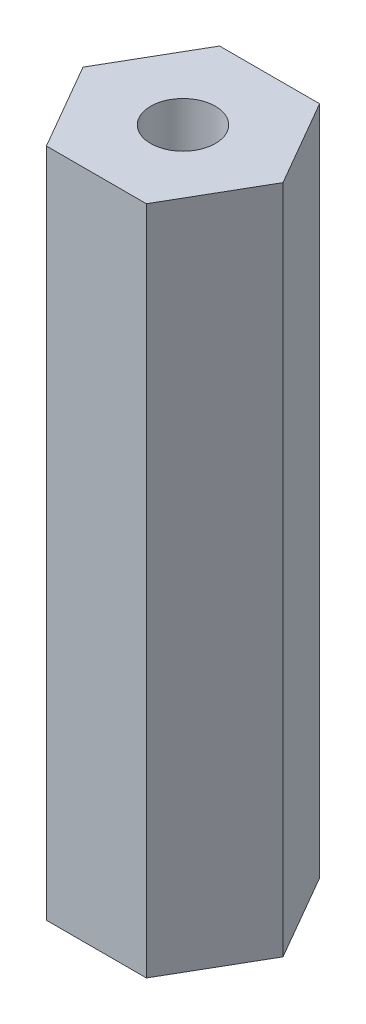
ISO-10303-21;
HEADER;
FILE_DESCRIPTION(('STEP AP214'),'2;1');
FILE_NAME('part.step','',(''),(''),'','','');
FILE_SCHEMA(('AUTOMOTIVE_DESIGN { 1 0 10303 214 1 1 1 1 }'));
ENDSEC;
DATA;
#1=APPLICATION_CONTEXT('core data for automotive mechanical design processes');
#2=APPLICATION_PROTOCOL_DEFINITION('international standard','automotive_design',2000,#1);
#3=PRODUCT_CONTEXT('',#1,'mechanical');
#4=PRODUCT('Part','Part','',(#3));
#5=PRODUCT_RELATED_PRODUCT_CATEGORY('part','',(#4));
#6=PRODUCT_DEFINITION_FORMATION('','',#4);
#7=PRODUCT_DEFINITION_CONTEXT('part definition',#1,'design');
#8=PRODUCT_DEFINITION('design','',#6,#7);
#9=PRODUCT_DEFINITION_SHAPE('','',#8);
#10=(LENGTH_UNIT() NAMED_UNIT(*) SI_UNIT(.MILLI.,.METRE.));
#11=(NAMED_UNIT(*) PLANE_ANGLE_UNIT() SI_UNIT($,.RADIAN.));
#12=(NAMED_UNIT(*) SI_UNIT($,.STERADIAN.) SOLID_ANGLE_UNIT());
#13=UNCERTAINTY_MEASURE_WITH_UNIT(LENGTH_MEASURE(1.E-05),#10,'distance_accuracy_value','');
#14=(GEOMETRIC_REPRESENTATION_CONTEXT(3) GLOBAL_UNCERTAINTY_ASSIGNED_CONTEXT((#13)) GLOBAL_UNIT_ASSIGNED_CONTEXT((#10,
#11,#12)) REPRESENTATION_CONTEXT('',''));
#15=CARTESIAN_POINT('',(0.,0.,0.));
#16=DIRECTION('',(0.,0.,1.));
#17=DIRECTION('',(1.,0.,0.));
#18=AXIS2_PLACEMENT_3D('',#15,#16,#17);
#19=CARTESIAN_POINT('',(2.19970452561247,29.499999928,3.81));
#20=DIRECTION('',(-0.866025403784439,0.,-0.5));
#21=DIRECTION('',(-0.5,0.,0.866025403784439));
#22=AXIS2_PLACEMENT_3D('',#19,#20,#21);
#23=PLANE('',#22);
#24=DIRECTION('',(0.5,0.,-0.866025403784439));
#25=VECTOR('',#24,1.);
#26=CARTESIAN_POINT('',(2.19970452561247,0.,3.81));
#27=LINE('',#26,#25);
#28=CARTESIAN_POINT('',(2.19970452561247,0.,3.81));
#29=VERTEX_POINT('',#28);
#30=CARTESIAN_POINT('',(4.39940905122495,0.,0.));
#31=VERTEX_POINT('',#30);
#32=EDGE_CURVE('E128',#29,#31,#27,.T.);
#33=ORIENTED_EDGE('',*,*,#32,.T.);
#34=DIRECTION('',(0.,-1.,0.));
#35=VECTOR('',#34,1.);
#36=CARTESIAN_POINT('',(4.39940905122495,29.499999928,0.));
#37=LINE('',#36,#35);
#38=CARTESIAN_POINT('',(4.39940905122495,29.499999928,0.));
#39=VERTEX_POINT('',#38);
#40=EDGE_CURVE('E11',#39,#31,#37,.T.);
#41=ORIENTED_EDGE('',*,*,#40,.F.);
#42=DIRECTION('',(0.5,0.,-0.866025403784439));
#43=VECTOR('',#42,1.);
#44=CARTESIAN_POINT('',(2.19970452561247,29.499999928,3.81));
#45=LINE('',#44,#43);
#46=CARTESIAN_POINT('',(2.19970452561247,29.499999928,3.81));
#47=VERTEX_POINT('',#46);
#48=EDGE_CURVE('E145',#47,#39,#45,.T.);
#49=ORIENTED_EDGE('',*,*,#48,.F.);
#50=DIRECTION('',(0.,-1.,0.));
#51=VECTOR('',#50,1.);
#52=CARTESIAN_POINT('',(2.19970452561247,29.499999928,3.81));
#53=LINE('',#52,#51);
#54=EDGE_CURVE('E124',#47,#29,#53,.T.);
#55=ORIENTED_EDGE('',*,*,#54,.T.);
#56=EDGE_LOOP('',(#33,#41,#49,#55));
#57=FACE_BOUND('',#56,.T.);
#58=ADVANCED_FACE('F39',(#57),#23,.F.);
#59=CARTESIAN_POINT('',(4.39940905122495,29.499999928,0.));
#60=DIRECTION('',(-0.866025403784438,0.,0.5));
#61=DIRECTION('',(0.5,0.,0.866025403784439));
#62=AXIS2_PLACEMENT_3D('',#59,#60,#61);
#63=PLANE('',#62);
#64=DIRECTION('',(-0.5,0.,-0.866025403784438));
#65=VECTOR('',#64,1.);
#66=CARTESIAN_POINT('',(4.39940905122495,0.,0.));
#67=LINE('',#66,#65);
#68=CARTESIAN_POINT('',(2.19970452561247,0.,-3.81));
#69=VERTEX_POINT('',#68);
#70=EDGE_CURVE('E132',#31,#69,#67,.T.);
#71=ORIENTED_EDGE('',*,*,#70,.T.);
#72=DIRECTION('',(0.,-1.,0.));
#73=VECTOR('',#72,1.);
#74=CARTESIAN_POINT('',(2.19970452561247,29.499999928,-3.81));
#75=LINE('',#74,#73);
#76=CARTESIAN_POINT('',(2.19970452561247,29.499999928,-3.81));
#77=VERTEX_POINT('',#76);
#78=EDGE_CURVE('E48',#77,#69,#75,.T.);
#79=ORIENTED_EDGE('',*,*,#78,.F.);
#80=DIRECTION('',(-0.5,0.,-0.866025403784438));
#81=VECTOR('',#80,1.);
#82=CARTESIAN_POINT('',(4.39940905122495,29.499999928,0.));
#83=LINE('',#82,#81);
#84=EDGE_CURVE('E93',#39,#77,#83,.T.);
#85=ORIENTED_EDGE('',*,*,#84,.F.);
#86=ORIENTED_EDGE('',*,*,#40,.T.);
#87=EDGE_LOOP('',(#71,#79,#85,#86));
#88=FACE_BOUND('',#87,.T.);
#89=ADVANCED_FACE('F174',(#88),#63,.F.);
#90=CARTESIAN_POINT('',(2.19970452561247,29.499999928,-3.81));
#91=DIRECTION('',(0.,0.,1.));
#92=DIRECTION('',(1.,0.,0.));
#93=AXIS2_PLACEMENT_3D('',#90,#91,#92);
#94=PLANE('',#93);
#95=DIRECTION('',(-1.,0.,0.));
#96=VECTOR('',#95,1.);
#97=CARTESIAN_POINT('',(2.19970452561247,0.,-3.81));
#98=LINE('',#97,#96);
#99=CARTESIAN_POINT('',(-2.19970452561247,0.,-3.81));
#100=VERTEX_POINT('',#99);
#101=EDGE_CURVE('E136',#69,#100,#98,.T.);
#102=ORIENTED_EDGE('',*,*,#101,.T.);
#103=DIRECTION('',(0.,-1.,0.));
#104=VECTOR('',#103,1.);
#105=CARTESIAN_POINT('',(-2.19970452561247,29.499999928,-3.81));
#106=LINE('',#105,#104);
#107=CARTESIAN_POINT('',(-2.19970452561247,29.499999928,-3.81));
#108=VERTEX_POINT('',#107);
#109=EDGE_CURVE('E117',#108,#100,#106,.T.);
#110=ORIENTED_EDGE('',*,*,#109,.F.);
#111=DIRECTION('',(-1.,0.,0.));
#112=VECTOR('',#111,1.);
#113=CARTESIAN_POINT('',(2.19970452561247,29.499999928,-3.81));
#114=LINE('',#113,#112);
#115=EDGE_CURVE('E106',#77,#108,#114,.T.);
#116=ORIENTED_EDGE('',*,*,#115,.F.);
#117=ORIENTED_EDGE('',*,*,#78,.T.);
#118=EDGE_LOOP('',(#102,#110,#116,#117));
#119=FACE_BOUND('',#118,.T.);
#120=ADVANCED_FACE('F155',(#119),#94,.F.);
#121=CARTESIAN_POINT('',(-2.19970452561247,29.499999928,-3.81));
#122=DIRECTION('',(0.866025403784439,0.,0.5));
#123=DIRECTION('',(0.5,0.,-0.866025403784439));
#124=AXIS2_PLACEMENT_3D('',#121,#122,#123);
#125=PLANE('',#124);
#126=DIRECTION('',(-0.5,0.,0.866025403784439));
#127=VECTOR('',#126,1.);
#128=CARTESIAN_POINT('',(-2.19970452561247,0.,-3.81));
#129=LINE('',#128,#127);
#130=CARTESIAN_POINT('',(-4.39940905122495,0.,0.));
#131=VERTEX_POINT('',#130);
#132=EDGE_CURVE('E115',#100,#131,#129,.T.);
#133=ORIENTED_EDGE('',*,*,#132,.T.);
#134=DIRECTION('',(0.,-1.,0.));
#135=VECTOR('',#134,1.);
#136=CARTESIAN_POINT('',(-4.39940905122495,29.499999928,0.));
#137=LINE('',#136,#135);
#138=CARTESIAN_POINT('',(-4.39940905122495,29.499999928,0.));
#139=VERTEX_POINT('',#138);
#140=EDGE_CURVE('E112',#139,#131,#137,.T.);
#141=ORIENTED_EDGE('',*,*,#140,.F.);
#142=DIRECTION('',(-0.5,0.,0.866025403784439));
#143=VECTOR('',#142,1.);
#144=CARTESIAN_POINT('',(-2.19970452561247,29.499999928,-3.81));
#145=LINE('',#144,#143);
#146=EDGE_CURVE('E100',#108,#139,#145,.T.);
#147=ORIENTED_EDGE('',*,*,#146,.F.);
#148=ORIENTED_EDGE('',*,*,#109,.T.);
#149=EDGE_LOOP('',(#133,#141,#147,#148));
#150=FACE_BOUND('',#149,.T.);
#151=ADVANCED_FACE('F113',(#150),#125,.F.);
#152=CARTESIAN_POINT('',(-4.39940905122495,29.499999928,0.));
#153=DIRECTION('',(0.866025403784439,0.,-0.5));
#154=DIRECTION('',(-0.5,0.,-0.866025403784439));
#155=AXIS2_PLACEMENT_3D('',#152,#153,#154);
#156=PLANE('',#155);
#157=DIRECTION('',(0.5,0.,0.866025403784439));
#158=VECTOR('',#157,1.);
#159=CARTESIAN_POINT('',(-4.39940905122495,0.,0.));
#160=LINE('',#159,#158);
#161=CARTESIAN_POINT('',(-2.19970452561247,0.,3.81));
#162=VERTEX_POINT('',#161);
#163=EDGE_CURVE('E79',#131,#162,#160,.T.);
#164=ORIENTED_EDGE('',*,*,#163,.T.);
#165=DIRECTION('',(0.,-1.,0.));
#166=VECTOR('',#165,1.);
#167=CARTESIAN_POINT('',(-2.19970452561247,29.499999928,3.81));
#168=LINE('',#167,#166);
#169=CARTESIAN_POINT('',(-2.19970452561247,29.499999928,3.81));
#170=VERTEX_POINT('',#169);
#171=EDGE_CURVE('E118',#170,#162,#168,.T.);
#172=ORIENTED_EDGE('',*,*,#171,.F.);
#173=DIRECTION('',(0.5,0.,0.866025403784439));
#174=VECTOR('',#173,1.);
#175=CARTESIAN_POINT('',(-4.39940905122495,29.499999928,0.));
#176=LINE('',#175,#174);
#177=EDGE_CURVE('E104',#139,#170,#176,.T.);
#178=ORIENTED_EDGE('',*,*,#177,.F.);
#179=ORIENTED_EDGE('',*,*,#140,.T.);
#180=EDGE_LOOP('',(#164,#172,#178,#179));
#181=FACE_BOUND('',#180,.T.);
#182=ADVANCED_FACE('F120',(#181),#156,.F.);
#183=CARTESIAN_POINT('',(-2.19970452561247,29.499999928,3.81));
#184=DIRECTION('',(0.,0.,-1.));
#185=DIRECTION('',(-1.,0.,0.));
#186=AXIS2_PLACEMENT_3D('',#183,#184,#185);
#187=PLANE('',#186);
#188=DIRECTION('',(1.,0.,0.));
#189=VECTOR('',#188,1.);
#190=CARTESIAN_POINT('',(-2.19970452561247,0.,3.81));
#191=LINE('',#190,#189);
#192=EDGE_CURVE('E85',#162,#29,#191,.T.);
#193=ORIENTED_EDGE('',*,*,#192,.T.);
#194=ORIENTED_EDGE('',*,*,#54,.F.);
#195=DIRECTION('',(1.,0.,0.));
#196=VECTOR('',#195,1.);
#197=CARTESIAN_POINT('',(-2.19970452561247,29.499999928,3.81));
#198=LINE('',#197,#196);
#199=EDGE_CURVE('E56',#170,#47,#198,.T.);
#200=ORIENTED_EDGE('',*,*,#199,.F.);
#201=ORIENTED_EDGE('',*,*,#171,.T.);
#202=EDGE_LOOP('',(#193,#194,#200,#201));
#203=FACE_BOUND('',#202,.T.);
#204=ADVANCED_FACE('F162',(#203),#187,.F.);
#205=CARTESIAN_POINT('',(0.,29.499999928,0.));
#206=DIRECTION('',(0.,1.,0.));
#207=DIRECTION('',(0.,0.,1.));
#208=AXIS2_PLACEMENT_3D('',#205,#206,#207);
#209=PLANE('',#208);
#210=CARTESIAN_POINT('',(0.,29.499999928,0.));
#211=DIRECTION('',(0.,-1.,0.));
#212=DIRECTION('',(0.,0.,-1.));
#213=AXIS2_PLACEMENT_3D('',#210,#211,#212);
#214=CIRCLE('',#213,1.4224);
#215=CARTESIAN_POINT('',(0.,29.499999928,-1.4224));
#216=VERTEX_POINT('',#215);
#217=EDGE_CURVE('E133',#216,#216,#214,.T.);
#218=ORIENTED_EDGE('',*,*,#217,.T.);
#219=EDGE_LOOP('',(#218));
#220=FACE_BOUND('',#219,.T.);
#221=ORIENTED_EDGE('',*,*,#48,.T.);
#222=ORIENTED_EDGE('',*,*,#84,.T.);
#223=ORIENTED_EDGE('',*,*,#115,.T.);
#224=ORIENTED_EDGE('',*,*,#146,.T.);
#225=ORIENTED_EDGE('',*,*,#177,.T.);
#226=ORIENTED_EDGE('',*,*,#199,.T.);
#227=EDGE_LOOP('',(#221,#222,#223,#224,#225,#226));
#228=FACE_BOUND('',#227,.T.);
#229=ADVANCED_FACE('F102',(#220,#228),#209,.T.);
#230=CARTESIAN_POINT('',(0.,0.,0.));
#231=DIRECTION('',(0.,1.,0.));
#232=DIRECTION('',(0.,0.,1.));
#233=AXIS2_PLACEMENT_3D('',#230,#231,#232);
#234=PLANE('',#233);
#235=CARTESIAN_POINT('',(0.,0.,0.));
#236=DIRECTION('',(0.,-1.,0.));
#237=DIRECTION('',(0.,0.,-1.));
#238=AXIS2_PLACEMENT_3D('',#235,#236,#237);
#239=CIRCLE('',#238,1.4224);
#240=CARTESIAN_POINT('',(0.,0.,-1.4224));
#241=VERTEX_POINT('',#240);
#242=EDGE_CURVE('E229',#241,#241,#239,.T.);
#243=ORIENTED_EDGE('',*,*,#242,.F.);
#244=EDGE_LOOP('',(#243));
#245=FACE_BOUND('',#244,.T.);
#246=ORIENTED_EDGE('',*,*,#32,.F.);
#247=ORIENTED_EDGE('',*,*,#192,.F.);
#248=ORIENTED_EDGE('',*,*,#163,.F.);
#249=ORIENTED_EDGE('',*,*,#132,.F.);
#250=ORIENTED_EDGE('',*,*,#101,.F.);
#251=ORIENTED_EDGE('',*,*,#70,.F.);
#252=EDGE_LOOP('',(#246,#247,#248,#249,#250,#251));
#253=FACE_BOUND('',#252,.T.);
#254=ADVANCED_FACE('F158',(#245,#253),#234,.F.);
#255=CARTESIAN_POINT('',(0.,29.499999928,0.));
#256=DIRECTION('',(0.,-1.,0.));
#257=DIRECTION('',(0.,0.,-1.));
#258=AXIS2_PLACEMENT_3D('',#255,#256,#257);
#259=CYLINDRICAL_SURFACE('',#258,1.4224);
#260=CARTESIAN_POINT('',(0.,29.499999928,-1.4224));
#261=CARTESIAN_POINT('',(0.,29.1927082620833,-1.4224));
#262=CARTESIAN_POINT('',(0.,28.8854165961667,-1.4224));
#263=CARTESIAN_POINT('',(0.,28.2708332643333,-1.4224));
#264=CARTESIAN_POINT('',(0.,27.9635415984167,-1.4224));
#265=CARTESIAN_POINT('',(0.,27.3489582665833,-1.4224));
#266=CARTESIAN_POINT('',(0.,27.0416666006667,-1.4224));
#267=CARTESIAN_POINT('',(0.,26.4270832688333,-1.4224));
#268=CARTESIAN_POINT('',(0.,26.1197916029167,-1.4224));
#269=CARTESIAN_POINT('',(0.,25.5052082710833,-1.4224));
#270=CARTESIAN_POINT('',(0.,25.1979166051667,-1.4224));
#271=CARTESIAN_POINT('',(0.,24.5833332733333,-1.4224));
#272=CARTESIAN_POINT('',(0.,24.2760416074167,-1.4224));
#273=CARTESIAN_POINT('',(0.,23.6614582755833,-1.4224));
#274=CARTESIAN_POINT('',(0.,23.3541666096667,-1.4224));
#275=CARTESIAN_POINT('',(0.,22.7395832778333,-1.4224));
#276=CARTESIAN_POINT('',(0.,22.4322916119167,-1.4224));
#277=CARTESIAN_POINT('',(0.,21.8177082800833,-1.4224));
#278=CARTESIAN_POINT('',(0.,21.5104166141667,-1.4224));
#279=CARTESIAN_POINT('',(0.,20.8958332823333,-1.4224));
#280=CARTESIAN_POINT('',(0.,20.5885416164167,-1.4224));
#281=CARTESIAN_POINT('',(0.,19.9739582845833,-1.4224));
#282=CARTESIAN_POINT('',(0.,19.6666666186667,-1.4224));
#283=CARTESIAN_POINT('',(0.,19.0520832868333,-1.4224));
#284=CARTESIAN_POINT('',(0.,18.7447916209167,-1.4224));
#285=CARTESIAN_POINT('',(0.,18.1302082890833,-1.4224));
#286=CARTESIAN_POINT('',(0.,17.8229166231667,-1.4224));
#287=CARTESIAN_POINT('',(0.,17.2083332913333,-1.4224));
#288=CARTESIAN_POINT('',(0.,16.9010416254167,-1.4224));
#289=CARTESIAN_POINT('',(0.,16.2864582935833,-1.4224));
#290=CARTESIAN_POINT('',(0.,15.9791666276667,-1.4224));
#291=CARTESIAN_POINT('',(0.,15.3645832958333,-1.4224));
#292=CARTESIAN_POINT('',(0.,15.0572916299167,-1.4224));
#293=CARTESIAN_POINT('',(0.,14.4427082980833,-1.4224));
#294=CARTESIAN_POINT('',(0.,14.1354166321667,-1.4224));
#295=CARTESIAN_POINT('',(0.,13.5208333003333,-1.4224));
#296=CARTESIAN_POINT('',(0.,13.2135416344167,-1.4224));
#297=CARTESIAN_POINT('',(0.,12.5989583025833,-1.4224));
#298=CARTESIAN_POINT('',(0.,12.2916666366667,-1.4224));
#299=CARTESIAN_POINT('',(0.,11.6770833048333,-1.4224));
#300=CARTESIAN_POINT('',(0.,11.3697916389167,-1.4224));
#301=CARTESIAN_POINT('',(0.,10.7552083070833,-1.4224));
#302=CARTESIAN_POINT('',(0.,10.4479166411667,-1.4224));
#303=CARTESIAN_POINT('',(0.,9.83333330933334,-1.4224));
#304=CARTESIAN_POINT('',(0.,9.52604164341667,-1.4224));
#305=CARTESIAN_POINT('',(0.,8.91145831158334,-1.4224));
#306=CARTESIAN_POINT('',(0.,8.60416664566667,-1.4224));
#307=CARTESIAN_POINT('',(0.,7.98958331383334,-1.4224));
#308=CARTESIAN_POINT('',(0.,7.68229164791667,-1.4224));
#309=CARTESIAN_POINT('',(0.,7.06770831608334,-1.4224));
#310=CARTESIAN_POINT('',(0.,6.76041665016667,-1.4224));
#311=CARTESIAN_POINT('',(0.,6.14583331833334,-1.4224));
#312=CARTESIAN_POINT('',(0.,5.83854165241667,-1.4224));
#313=CARTESIAN_POINT('',(0.,5.22395832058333,-1.4224));
#314=CARTESIAN_POINT('',(0.,4.91666665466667,-1.4224));
#315=CARTESIAN_POINT('',(0.,4.30208332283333,-1.4224));
#316=CARTESIAN_POINT('',(0.,3.99479165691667,-1.4224));
#317=CARTESIAN_POINT('',(0.,3.38020832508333,-1.4224));
#318=CARTESIAN_POINT('',(0.,3.07291665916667,-1.4224));
#319=CARTESIAN_POINT('',(0.,2.45833332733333,-1.4224));
#320=CARTESIAN_POINT('',(0.,2.15104166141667,-1.4224));
#321=CARTESIAN_POINT('',(0.,1.53645832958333,-1.4224));
#322=CARTESIAN_POINT('',(0.,1.22916666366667,-1.4224));
#323=CARTESIAN_POINT('',(0.,0.614583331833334,-1.4224));
#324=CARTESIAN_POINT('',(0.,0.307291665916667,-1.4224));
#325=CARTESIAN_POINT('',(0.,0.,-1.4224));
#326=B_SPLINE_CURVE_WITH_KNOTS('',3,(#260,#261,#262,#263,#264,#265,#266,#267,#268,#269,#270,
#271,#272,#273,#274,#275,#276,#277,#278,#279,#280,#281,#282,#283,#284,#285,#286,#287,#288,#289,
#290,#291,#292,#293,#294,#295,#296,#297,#298,#299,#300,#301,#302,#303,#304,#305,#306,#307,#308,
#309,#310,#311,#312,#313,#314,#315,#316,#317,#318,#319,#320,#321,#322,#323,#324,#325),
.UNSPECIFIED.,.F.,.F.,(4,2,2,2,2,2,2,2,2,2,2,2,2,2,2,2,2,2,2,2,2,2,2,2,2,2,2,2,2,2,2,2,4),(0.,
0.92187499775,1.8437499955,2.76562499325,3.687499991,4.60937498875,5.5312499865,6.45312498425,
7.374999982,8.29687497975,9.2187499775,10.14062497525,11.062499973,11.98437497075,12.9062499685,
13.82812496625,14.749999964,15.67187496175,16.5937499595,17.51562495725,18.437499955,
19.35937495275,20.2812499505,21.20312494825,22.124999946,23.04687494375,23.9687499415,
24.89062493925,25.812499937,26.73437493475,27.6562499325,28.57812493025,29.499999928),.UNSPECIFIED.);
#327=EDGE_CURVE('BSEAM211',#216,#241,#326,.T.);
#328=ORIENTED_EDGE('',*,*,#217,.F.);
#329=ORIENTED_EDGE('',*,*,#242,.T.);
#330=ORIENTED_EDGE('',*,*,#327,.T.);
#331=ORIENTED_EDGE('',*,*,#327,.F.);
#332=EDGE_LOOP('',(#328,#330,#329,#331));
#333=FACE_BOUND('',#332,.T.);
#334=ADVANCED_FACE('F211',(#333),#259,.F.);
#335=CLOSED_SHELL('',(#58,#89,#120,#151,#182,#204,#229,#254,#334));
#336=MANIFOLD_SOLID_BREP('B2',#335);
#337=ADVANCED_BREP_SHAPE_REPRESENTATION('',(#18,#336),#14);
#338=SHAPE_DEFINITION_REPRESENTATION(#9,#337);
ENDSEC;
END-ISO-10303-21;
